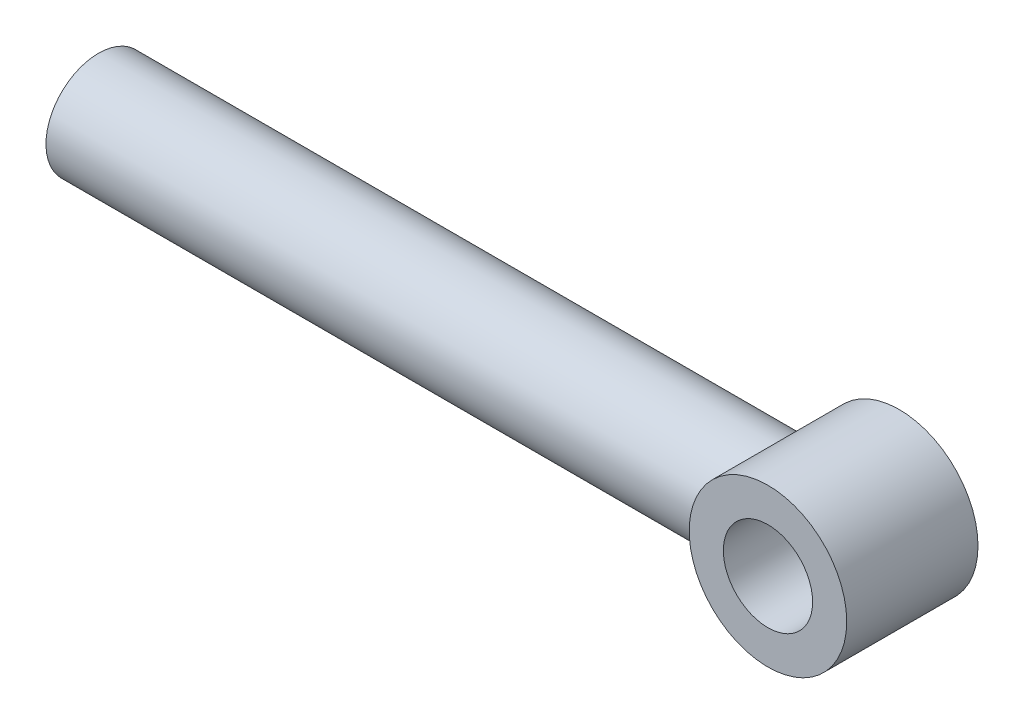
from build123d import *

# Parameters (mm, degrees)
SKETCH1_R               = 75
BASE_EXTRUDE_DEPTH      = 62.5
SKETCH2_W               = 700
SKETCH2_H               = 50
CUT_EXTRUDE1_DEPTH      = 707.77524728
CUT_EXTRUDE1_DEPTH_BACK = 707.77524728
SKETCH3_R               = 42.5


with BuildPart() as part:
    # Sketch1 → Base-Extrude (new, symmetric)
    with BuildSketch(Plane.XY):
        Circle(SKETCH1_R)
    extrude(amount=BASE_EXTRUDE_DEPTH, both=True)

    # Sketch2 → Boss-Revolve1 (revolve)
    with BuildSketch(Plane.XY):
        with Locations((-350, 25)):
            Rectangle(SKETCH2_W, SKETCH2_H)
    revolve(axis=Axis((0, 0, 0), (-1, 0, 0)))

    # Sketch3 → Cut-Extrude1 (cut, two sides: drawn at the far end of the back side and taken through both)
    with BuildSketch(Plane.XY.offset(-CUT_EXTRUDE1_DEPTH_BACK)):
        Circle(SKETCH3_R)
    extrude(amount=CUT_EXTRUDE1_DEPTH + CUT_EXTRUDE1_DEPTH_BACK, mode=Mode.SUBTRACT)


solid = part.part
